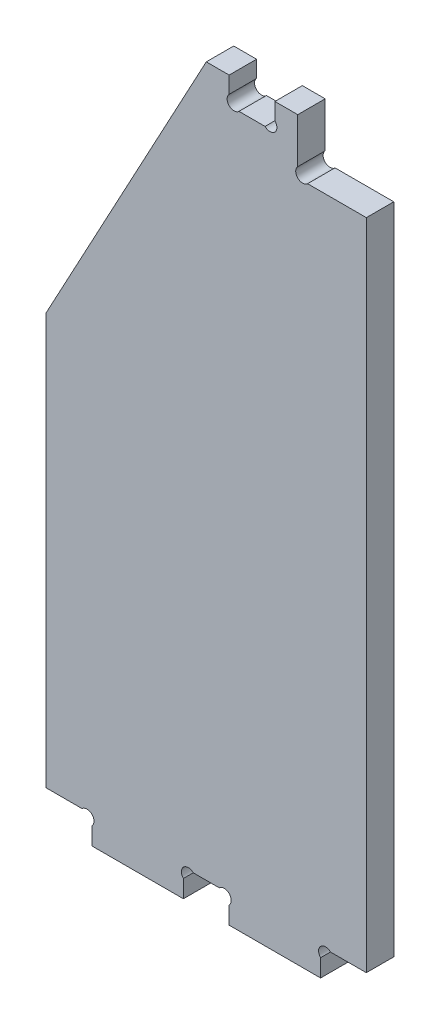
from build123d import *

# Parameters (mm, degrees)
EXTRUSION1_DEPTH = 6


with BuildPart() as part:
    # Esquisse1 → Extrusion1 (new body)
    with BuildSketch(Plane.XY):
        with BuildLine():
            Line((0, 0), (7.850395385, 0))
            ThreePointArc((7.850395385, 0), (10, 0), (10, -2.149604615))
            Line((10, -2.149604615), (10, -6))
            Line((10, -6), (30, -6))
            Line((30, -6), (30, -2.149604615))
            ThreePointArc((30, -2.149604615), (30, 0), (32.149604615, 0))
            Line((32.149604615, 0), (37.850395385, 0))
            ThreePointArc((37.850395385, 0), (40, 0), (40, -2.149604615))
            Line((40, -2.149604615), (40, -6))
            Line((40, -6), (60, -6))
            Line((60, -6), (60, -2.149604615))
            ThreePointArc((60, -2.149604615), (60, 0), (62.149604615, 0))
            Line((62.149604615, 0), (70, 0))
            Line((70, 0), (70, 143))
            Line((70, 143), (57.149604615, 143))
            ThreePointArc((57.149604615, 143), (55, 143), (55, 145.149604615))
            Line((55, 145.149604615), (55, 155))
            Line((55, 155), (50, 155))
            Line((50, 155), (50, 151.349604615))
            ThreePointArc((50, 151.349604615), (50, 149.2), (47.850395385, 149.2))
            Line((47.850395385, 149.2), (42.149604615, 149.2))
            ThreePointArc((42.149604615, 149.2), (40, 149.2), (40, 151.349604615))
            Line((40, 151.349604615), (40, 155))
            Line((40, 155), (35, 155))
            Line((35, 155), (0, 90))
            Line((0, 90), (0, 0))
        make_face()
    extrude(amount=EXTRUSION1_DEPTH)


solid = part.part
